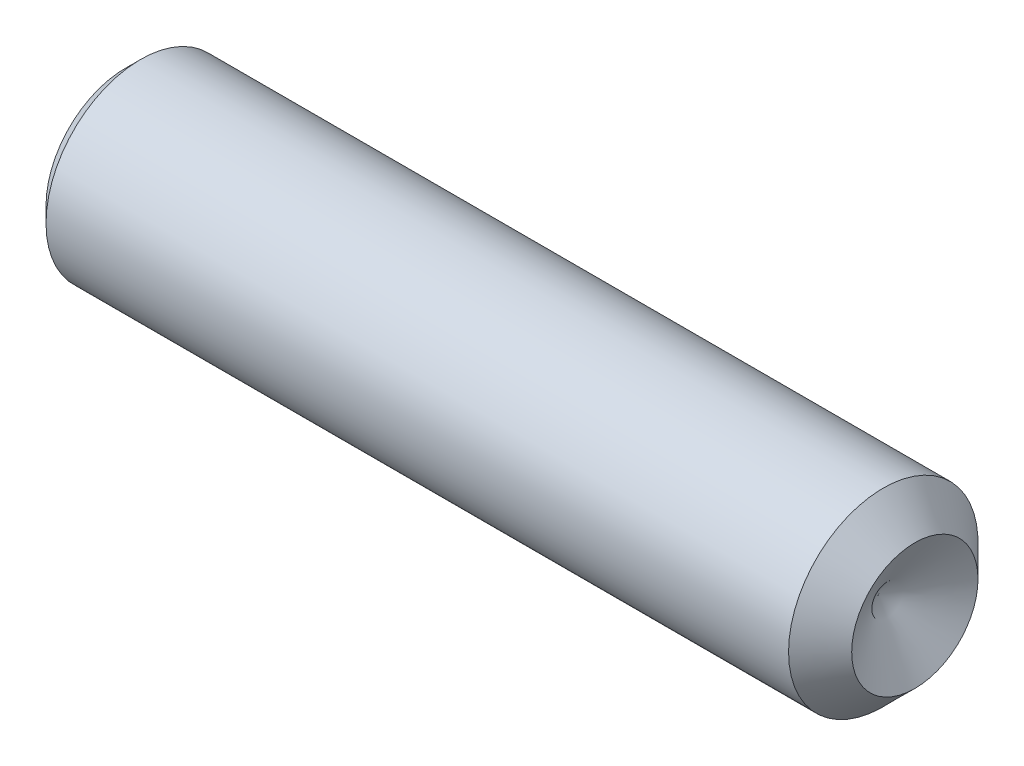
from build123d import *

# Parameters (mm, degrees)
COUNTERSINK_DEPTH = 8


with BuildPart() as part:
    # BodySke → BaseBody (revolve)
    with BuildSketch(Plane.XY, mode=Mode.PRIVATE) as basebody_sk:
        Polygon((0, 0), (0, 5.036), (0.964, 6), (48, 6), (50, 4), (47.690598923, 0), align=None)
    revolve(basebody_sk.sketch.rotate(Axis((0, 0, 0), (1, 0, 0)), 90), axis=Axis((0, 0, 0), (1, 0, 0)))

    # CountersinkSke → Countersink (cut)
    with BuildSketch(Plane(origin=(0, 0, 0), x_dir=(0, 0, -1), z_dir=(1, 0, 0))):
        Polygon((0, 3.464101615), (-3, 1.732050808), (-3, -1.732050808), (0, -3.464101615), (3, -1.732050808), (3, 1.732050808), align=None)
    extrude(amount=COUNTERSINK_DEPTH, mode=Mode.SUBTRACT)


solid = part.part
